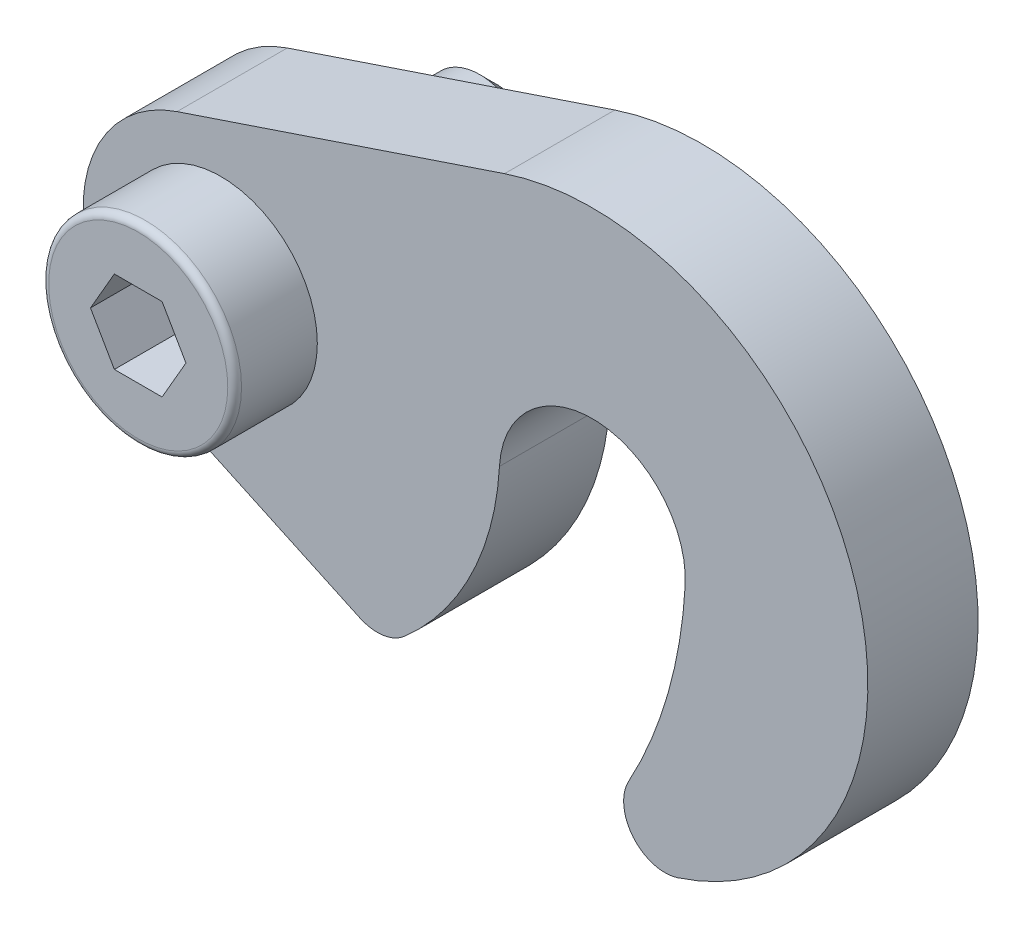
ISO-10303-21;
HEADER;
FILE_DESCRIPTION(('STEP AP214'),'2;1');
FILE_NAME('part.step','',(''),(''),'','','');
FILE_SCHEMA(('AUTOMOTIVE_DESIGN { 1 0 10303 214 1 1 1 1 }'));
ENDSEC;
DATA;
#1=APPLICATION_CONTEXT('core data for automotive mechanical design processes');
#2=APPLICATION_PROTOCOL_DEFINITION('international standard','automotive_design',2000,#1);
#3=PRODUCT_CONTEXT('',#1,'mechanical');
#4=PRODUCT('Part','Part','',(#3));
#5=PRODUCT_RELATED_PRODUCT_CATEGORY('part','',(#4));
#6=PRODUCT_DEFINITION_FORMATION('','',#4);
#7=PRODUCT_DEFINITION_CONTEXT('part definition',#1,'design');
#8=PRODUCT_DEFINITION('design','',#6,#7);
#9=PRODUCT_DEFINITION_SHAPE('','',#8);
#10=(LENGTH_UNIT() NAMED_UNIT(*) SI_UNIT(.MILLI.,.METRE.));
#11=(NAMED_UNIT(*) PLANE_ANGLE_UNIT() SI_UNIT($,.RADIAN.));
#12=(NAMED_UNIT(*) SI_UNIT($,.STERADIAN.) SOLID_ANGLE_UNIT());
#13=UNCERTAINTY_MEASURE_WITH_UNIT(LENGTH_MEASURE(1.E-05),#10,'distance_accuracy_value','');
#14=(GEOMETRIC_REPRESENTATION_CONTEXT(3) GLOBAL_UNCERTAINTY_ASSIGNED_CONTEXT((#13)) GLOBAL_UNIT_ASSIGNED_CONTEXT((#10,
#11,#12)) REPRESENTATION_CONTEXT('',''));
#15=CARTESIAN_POINT('',(0.,0.,0.));
#16=DIRECTION('',(0.,0.,1.));
#17=DIRECTION('',(1.,0.,0.));
#18=AXIS2_PLACEMENT_3D('',#15,#16,#17);
#19=CARTESIAN_POINT('',(0.,0.,1.));
#20=DIRECTION('',(0.,0.,1.));
#21=DIRECTION('',(0.,-1.,0.));
#22=AXIS2_PLACEMENT_3D('',#19,#20,#21);
#23=PLANE('',#22);
#24=CARTESIAN_POINT('',(0.,0.,1.));
#25=DIRECTION('',(0.,0.,-1.));
#26=DIRECTION('',(0.,1.,0.));
#27=AXIS2_PLACEMENT_3D('',#24,#25,#26);
#28=CIRCLE('',#27,5.25);
#29=CARTESIAN_POINT('',(0.,5.25,1.));
#30=VERTEX_POINT('',#29);
#31=EDGE_CURVE('E179',#30,#30,#28,.T.);
#32=ORIENTED_EDGE('',*,*,#31,.F.);
#33=EDGE_LOOP('',(#32));
#34=FACE_BOUND('',#33,.T.);
#35=CARTESIAN_POINT('',(0.,0.,1.));
#36=DIRECTION('',(0.,0.,1.));
#37=DIRECTION('',(0.,-1.,0.));
#38=AXIS2_PLACEMENT_3D('',#35,#36,#37);
#39=CIRCLE('',#38,33.75);
#40=CARTESIAN_POINT('',(29.6010941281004,-16.2122708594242,1.));
#41=VERTEX_POINT('',#40);
#42=CARTESIAN_POINT('',(33.6984313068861,-1.8650006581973,1.));
#43=VERTEX_POINT('',#42);
#44=EDGE_CURVE('E193',#41,#43,#39,.T.);
#45=ORIENTED_EDGE('',*,*,#44,.T.);
#46=CARTESIAN_POINT('',(26.9587450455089,-1.49200052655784,1.));
#47=DIRECTION('',(0.,0.,1.));
#48=DIRECTION('',(0.,-1.,0.));
#49=AXIS2_PLACEMENT_3D('',#46,#47,#48);
#50=CIRCLE('',#49,6.75);
#51=CARTESIAN_POINT('',(20.2190587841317,-1.11900039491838,1.));
#52=VERTEX_POINT('',#51);
#53=EDGE_CURVE('E198',#43,#52,#50,.T.);
#54=ORIENTED_EDGE('',*,*,#53,.T.);
#55=CARTESIAN_POINT('',(0.,0.,1.));
#56=DIRECTION('',(0.,0.,1.));
#57=DIRECTION('',(0.,-1.,0.));
#58=AXIS2_PLACEMENT_3D('',#55,#56,#57);
#59=CIRCLE('',#58,20.25);
#60=CARTESIAN_POINT('',(13.3258827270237,-15.247404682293,1.));
#61=VERTEX_POINT('',#60);
#62=EDGE_CURVE('E201',#61,#52,#59,.T.);
#63=ORIENTED_EDGE('',*,*,#62,.F.);
#64=CARTESIAN_POINT('',(11.3516778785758,-12.9885299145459,1.));
#65=DIRECTION('',(0.,0.,1.));
#66=DIRECTION('',(0.,-1.,0.));
#67=AXIS2_PLACEMENT_3D('',#64,#65,#66);
#68=CIRCLE('',#67,3.);
#69=CARTESIAN_POINT('',(10.0882760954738,-15.7095253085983,1.));
#70=VERTEX_POINT('',#69);
#71=EDGE_CURVE('E204',#70,#61,#68,.T.);
#72=ORIENTED_EDGE('',*,*,#71,.F.);
#73=DIRECTION('',(-0.906998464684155,0.421133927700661,0.));
#74=VECTOR('',#73,1.);
#75=CARTESIAN_POINT('',(10.0882760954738,-15.7095253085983,1.));
#76=LINE('',#75,#74);
#77=CARTESIAN_POINT('',(-4.21133927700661,-9.06998464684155,1.));
#78=VERTEX_POINT('',#77);
#79=EDGE_CURVE('E207',#70,#78,#76,.T.);
#80=ORIENTED_EDGE('',*,*,#79,.T.);
#81=CARTESIAN_POINT('',(0.,0.,1.));
#82=DIRECTION('',(0.,0.,1.));
#83=DIRECTION('',(0.,-1.,0.));
#84=AXIS2_PLACEMENT_3D('',#81,#82,#83);
#85=CIRCLE('',#84,10.);
#86=CARTESIAN_POINT('',(-3.184749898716,9.47931263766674,1.));
#87=VERTEX_POINT('',#86);
#88=EDGE_CURVE('E210',#87,#78,#85,.T.);
#89=ORIENTED_EDGE('',*,*,#88,.F.);
#90=DIRECTION('',(0.947931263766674,0.3184749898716,0.));
#91=VECTOR('',#90,1.);
#92=CARTESIAN_POINT('',(-3.184749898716,9.47931263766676,1.));
#93=LINE('',#92,#91);
#94=CARTESIAN_POINT('',(20.5892452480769,17.4666247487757,1.));
#95=VERTEX_POINT('',#94);
#96=EDGE_CURVE('E213',#87,#95,#93,.T.);
#97=ORIENTED_EDGE('',*,*,#96,.T.);
#98=CARTESIAN_POINT('',(26.9587450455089,-1.49200052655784,1.));
#99=DIRECTION('',(0.,0.,1.));
#100=DIRECTION('',(0.,-1.,0.));
#101=AXIS2_PLACEMENT_3D('',#98,#99,#100);
#102=CIRCLE('',#101,20.);
#103=CARTESIAN_POINT('',(33.1629302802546,-20.5053664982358,1.));
#104=VERTEX_POINT('',#103);
#105=EDGE_CURVE('E216',#104,#95,#102,.T.);
#106=ORIENTED_EDGE('',*,*,#105,.F.);
#107=CARTESIAN_POINT('',(32.2323024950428,-17.6533616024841,1.));
#108=DIRECTION('',(0.,0.,-1.));
#109=DIRECTION('',(0.,1.,0.));
#110=AXIS2_PLACEMENT_3D('',#107,#108,#109);
#111=CIRCLE('',#110,3.);
#112=EDGE_CURVE('E219',#104,#41,#111,.T.);
#113=ORIENTED_EDGE('',*,*,#112,.T.);
#114=EDGE_LOOP('',(#45,#54,#63,#72,#80,#89,#97,#106,#113));
#115=FACE_BOUND('',#114,.T.);
#116=ADVANCED_FACE('F14',(#34,#115),#23,.F.);
#117=CARTESIAN_POINT('',(0.,0.,9.));
#118=DIRECTION('',(0.,0.,-1.));
#119=DIRECTION('',(0.,1.,0.));
#120=AXIS2_PLACEMENT_3D('',#117,#118,#119);
#121=CYLINDRICAL_SURFACE('',#120,33.75);
#122=DIRECTION('',(0.,0.,-1.));
#123=VECTOR('',#122,1.);
#124=CARTESIAN_POINT('',(29.6010941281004,-16.2122708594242,9.));
#125=LINE('',#124,#123);
#126=CARTESIAN_POINT('',(29.6010941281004,-16.2122708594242,9.));
#127=VERTEX_POINT('',#126);
#128=EDGE_CURVE('E37',#127,#41,#125,.T.);
#129=ORIENTED_EDGE('',*,*,#128,.F.);
#130=CARTESIAN_POINT('',(0.,0.,9.));
#131=DIRECTION('',(0.,0.,1.));
#132=DIRECTION('',(0.,-1.,0.));
#133=AXIS2_PLACEMENT_3D('',#130,#131,#132);
#134=CIRCLE('',#133,33.75);
#135=CARTESIAN_POINT('',(33.6984313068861,-1.8650006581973,9.));
#136=VERTEX_POINT('',#135);
#137=EDGE_CURVE('E222',#127,#136,#134,.T.);
#138=ORIENTED_EDGE('',*,*,#137,.T.);
#139=DIRECTION('',(0.,0.,-1.));
#140=VECTOR('',#139,1.);
#141=CARTESIAN_POINT('',(33.6984313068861,-1.8650006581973,9.));
#142=LINE('',#141,#140);
#143=EDGE_CURVE('E248',#136,#43,#142,.T.);
#144=ORIENTED_EDGE('',*,*,#143,.T.);
#145=ORIENTED_EDGE('',*,*,#44,.F.);
#146=EDGE_LOOP('',(#129,#138,#144,#145));
#147=FACE_BOUND('',#146,.T.);
#148=ADVANCED_FACE('F284',(#147),#121,.F.);
#149=CARTESIAN_POINT('',(32.2323024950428,-17.6533616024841,9.));
#150=DIRECTION('',(0.,0.,-1.));
#151=DIRECTION('',(0.,1.,0.));
#152=AXIS2_PLACEMENT_3D('',#149,#150,#151);
#153=CYLINDRICAL_SURFACE('',#152,3.);
#154=DIRECTION('',(0.,0.,-1.));
#155=VECTOR('',#154,1.);
#156=CARTESIAN_POINT('',(33.1629302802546,-20.5053664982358,9.));
#157=LINE('',#156,#155);
#158=CARTESIAN_POINT('',(33.1629302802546,-20.5053664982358,9.));
#159=VERTEX_POINT('',#158);
#160=EDGE_CURVE('E262',#159,#104,#157,.T.);
#161=ORIENTED_EDGE('',*,*,#160,.F.);
#162=CARTESIAN_POINT('',(32.2323024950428,-17.6533616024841,9.));
#163=DIRECTION('',(0.,0.,-1.));
#164=DIRECTION('',(0.,1.,0.));
#165=AXIS2_PLACEMENT_3D('',#162,#163,#164);
#166=CIRCLE('',#165,3.);
#167=EDGE_CURVE('E245',#159,#127,#166,.T.);
#168=ORIENTED_EDGE('',*,*,#167,.T.);
#169=ORIENTED_EDGE('',*,*,#128,.T.);
#170=ORIENTED_EDGE('',*,*,#112,.F.);
#171=EDGE_LOOP('',(#161,#168,#169,#170));
#172=FACE_BOUND('',#171,.T.);
#173=ADVANCED_FACE('F291',(#172),#153,.T.);
#174=CARTESIAN_POINT('',(26.9587450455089,-1.49200052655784,9.));
#175=DIRECTION('',(0.,0.,-1.));
#176=DIRECTION('',(0.,1.,0.));
#177=AXIS2_PLACEMENT_3D('',#174,#175,#176);
#178=CYLINDRICAL_SURFACE('',#177,20.);
#179=DIRECTION('',(0.,0.,-1.));
#180=VECTOR('',#179,1.);
#181=CARTESIAN_POINT('',(20.5892452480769,17.4666247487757,9.));
#182=LINE('',#181,#180);
#183=CARTESIAN_POINT('',(20.5892452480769,17.4666247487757,9.));
#184=VERTEX_POINT('',#183);
#185=EDGE_CURVE('E260',#184,#95,#182,.T.);
#186=ORIENTED_EDGE('',*,*,#185,.F.);
#187=CARTESIAN_POINT('',(26.9587450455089,-1.49200052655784,9.));
#188=DIRECTION('',(0.,0.,1.));
#189=DIRECTION('',(0.,-1.,0.));
#190=AXIS2_PLACEMENT_3D('',#187,#188,#189);
#191=CIRCLE('',#190,20.);
#192=EDGE_CURVE('E242',#159,#184,#191,.T.);
#193=ORIENTED_EDGE('',*,*,#192,.F.);
#194=ORIENTED_EDGE('',*,*,#160,.T.);
#195=ORIENTED_EDGE('',*,*,#105,.T.);
#196=EDGE_LOOP('',(#186,#193,#194,#195));
#197=FACE_BOUND('',#196,.T.);
#198=ADVANCED_FACE('F327',(#197),#178,.T.);
#199=CARTESIAN_POINT('',(-3.184749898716,9.47931263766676,9.));
#200=DIRECTION('',(-0.3184749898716,0.947931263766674,0.));
#201=DIRECTION('',(-0.947931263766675,-0.3184749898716,0.));
#202=AXIS2_PLACEMENT_3D('',#199,#200,#201);
#203=PLANE('',#202);
#204=DIRECTION('',(0.,0.,-1.));
#205=VECTOR('',#204,1.);
#206=CARTESIAN_POINT('',(-3.184749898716,9.47931263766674,9.));
#207=LINE('',#206,#205);
#208=CARTESIAN_POINT('',(-3.184749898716,9.47931263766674,9.));
#209=VERTEX_POINT('',#208);
#210=EDGE_CURVE('E258',#209,#87,#207,.T.);
#211=ORIENTED_EDGE('',*,*,#210,.F.);
#212=DIRECTION('',(0.947931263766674,0.3184749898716,0.));
#213=VECTOR('',#212,1.);
#214=CARTESIAN_POINT('',(-3.184749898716,9.47931263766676,9.));
#215=LINE('',#214,#213);
#216=EDGE_CURVE('E239',#209,#184,#215,.T.);
#217=ORIENTED_EDGE('',*,*,#216,.T.);
#218=ORIENTED_EDGE('',*,*,#185,.T.);
#219=ORIENTED_EDGE('',*,*,#96,.F.);
#220=EDGE_LOOP('',(#211,#217,#218,#219));
#221=FACE_BOUND('',#220,.T.);
#222=ADVANCED_FACE('F323',(#221),#203,.T.);
#223=CARTESIAN_POINT('',(0.,0.,9.));
#224=DIRECTION('',(0.,0.,-1.));
#225=DIRECTION('',(0.,1.,0.));
#226=AXIS2_PLACEMENT_3D('',#223,#224,#225);
#227=CYLINDRICAL_SURFACE('',#226,10.);
#228=DIRECTION('',(0.,0.,-1.));
#229=VECTOR('',#228,1.);
#230=CARTESIAN_POINT('',(-4.21133927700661,-9.06998464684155,9.));
#231=LINE('',#230,#229);
#232=CARTESIAN_POINT('',(-4.21133927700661,-9.06998464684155,9.));
#233=VERTEX_POINT('',#232);
#234=EDGE_CURVE('E256',#233,#78,#231,.T.);
#235=ORIENTED_EDGE('',*,*,#234,.F.);
#236=CARTESIAN_POINT('',(0.,0.,9.));
#237=DIRECTION('',(0.,0.,1.));
#238=DIRECTION('',(0.,-1.,0.));
#239=AXIS2_PLACEMENT_3D('',#236,#237,#238);
#240=CIRCLE('',#239,10.);
#241=EDGE_CURVE('E236',#209,#233,#240,.T.);
#242=ORIENTED_EDGE('',*,*,#241,.F.);
#243=ORIENTED_EDGE('',*,*,#210,.T.);
#244=ORIENTED_EDGE('',*,*,#88,.T.);
#245=EDGE_LOOP('',(#235,#242,#243,#244));
#246=FACE_BOUND('',#245,.T.);
#247=ADVANCED_FACE('F319',(#246),#227,.T.);
#248=CARTESIAN_POINT('',(10.0882760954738,-15.7095253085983,9.));
#249=DIRECTION('',(-0.421133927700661,-0.906998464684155,0.));
#250=DIRECTION('',(0.906998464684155,-0.421133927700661,0.));
#251=AXIS2_PLACEMENT_3D('',#248,#249,#250);
#252=PLANE('',#251);
#253=DIRECTION('',(0.,0.,-1.));
#254=VECTOR('',#253,1.);
#255=CARTESIAN_POINT('',(10.0882760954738,-15.7095253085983,9.));
#256=LINE('',#255,#254);
#257=CARTESIAN_POINT('',(10.0882760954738,-15.7095253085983,9.));
#258=VERTEX_POINT('',#257);
#259=EDGE_CURVE('E254',#258,#70,#256,.T.);
#260=ORIENTED_EDGE('',*,*,#259,.F.);
#261=DIRECTION('',(-0.906998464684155,0.421133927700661,0.));
#262=VECTOR('',#261,1.);
#263=CARTESIAN_POINT('',(10.0882760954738,-15.7095253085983,9.));
#264=LINE('',#263,#262);
#265=EDGE_CURVE('E233',#258,#233,#264,.T.);
#266=ORIENTED_EDGE('',*,*,#265,.T.);
#267=ORIENTED_EDGE('',*,*,#234,.T.);
#268=ORIENTED_EDGE('',*,*,#79,.F.);
#269=EDGE_LOOP('',(#260,#266,#267,#268));
#270=FACE_BOUND('',#269,.T.);
#271=ADVANCED_FACE('F315',(#270),#252,.T.);
#272=CARTESIAN_POINT('',(11.3516778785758,-12.9885299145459,9.));
#273=DIRECTION('',(0.,0.,-1.));
#274=DIRECTION('',(0.,1.,0.));
#275=AXIS2_PLACEMENT_3D('',#272,#273,#274);
#276=CYLINDRICAL_SURFACE('',#275,3.);
#277=DIRECTION('',(0.,0.,-1.));
#278=VECTOR('',#277,1.);
#279=CARTESIAN_POINT('',(13.3258827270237,-15.247404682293,9.));
#280=LINE('',#279,#278);
#281=CARTESIAN_POINT('',(13.3258827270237,-15.247404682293,9.));
#282=VERTEX_POINT('',#281);
#283=EDGE_CURVE('E252',#282,#61,#280,.T.);
#284=ORIENTED_EDGE('',*,*,#283,.F.);
#285=CARTESIAN_POINT('',(11.3516778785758,-12.9885299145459,9.));
#286=DIRECTION('',(0.,0.,1.));
#287=DIRECTION('',(0.,-1.,0.));
#288=AXIS2_PLACEMENT_3D('',#285,#286,#287);
#289=CIRCLE('',#288,3.);
#290=EDGE_CURVE('E230',#258,#282,#289,.T.);
#291=ORIENTED_EDGE('',*,*,#290,.F.);
#292=ORIENTED_EDGE('',*,*,#259,.T.);
#293=ORIENTED_EDGE('',*,*,#71,.T.);
#294=EDGE_LOOP('',(#284,#291,#292,#293));
#295=FACE_BOUND('',#294,.T.);
#296=ADVANCED_FACE('F311',(#295),#276,.T.);
#297=CARTESIAN_POINT('',(0.,0.,9.));
#298=DIRECTION('',(0.,0.,-1.));
#299=DIRECTION('',(0.,1.,0.));
#300=AXIS2_PLACEMENT_3D('',#297,#298,#299);
#301=CYLINDRICAL_SURFACE('',#300,20.25);
#302=DIRECTION('',(0.,0.,-1.));
#303=VECTOR('',#302,1.);
#304=CARTESIAN_POINT('',(20.2190587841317,-1.11900039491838,9.));
#305=LINE('',#304,#303);
#306=CARTESIAN_POINT('',(20.2190587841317,-1.11900039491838,9.));
#307=VERTEX_POINT('',#306);
#308=EDGE_CURVE('E250',#307,#52,#305,.T.);
#309=ORIENTED_EDGE('',*,*,#308,.F.);
#310=CARTESIAN_POINT('',(0.,0.,9.));
#311=DIRECTION('',(0.,0.,1.));
#312=DIRECTION('',(0.,-1.,0.));
#313=AXIS2_PLACEMENT_3D('',#310,#311,#312);
#314=CIRCLE('',#313,20.25);
#315=EDGE_CURVE('E227',#282,#307,#314,.T.);
#316=ORIENTED_EDGE('',*,*,#315,.F.);
#317=ORIENTED_EDGE('',*,*,#283,.T.);
#318=ORIENTED_EDGE('',*,*,#62,.T.);
#319=EDGE_LOOP('',(#309,#316,#317,#318));
#320=FACE_BOUND('',#319,.T.);
#321=ADVANCED_FACE('F303',(#320),#301,.T.);
#322=CARTESIAN_POINT('',(26.9587450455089,-1.49200052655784,9.));
#323=DIRECTION('',(0.,0.,-1.));
#324=DIRECTION('',(0.,1.,0.));
#325=AXIS2_PLACEMENT_3D('',#322,#323,#324);
#326=CYLINDRICAL_SURFACE('',#325,6.75);
#327=CARTESIAN_POINT('',(26.9587450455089,-1.49200052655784,9.));
#328=DIRECTION('',(0.,0.,1.));
#329=DIRECTION('',(0.,-1.,0.));
#330=AXIS2_PLACEMENT_3D('',#327,#328,#329);
#331=CIRCLE('',#330,6.75);
#332=EDGE_CURVE('E224',#136,#307,#331,.T.);
#333=ORIENTED_EDGE('',*,*,#332,.T.);
#334=ORIENTED_EDGE('',*,*,#308,.T.);
#335=ORIENTED_EDGE('',*,*,#53,.F.);
#336=ORIENTED_EDGE('',*,*,#143,.F.);
#337=EDGE_LOOP('',(#333,#334,#335,#336));
#338=FACE_BOUND('',#337,.T.);
#339=ADVANCED_FACE('F301',(#338),#326,.F.);
#340=CARTESIAN_POINT('',(0.,0.,9.));
#341=DIRECTION('',(0.,0.,1.));
#342=DIRECTION('',(0.,-1.,0.));
#343=AXIS2_PLACEMENT_3D('',#340,#341,#342);
#344=PLANE('',#343);
#345=CARTESIAN_POINT('',(0.,0.,9.));
#346=DIRECTION('',(0.,0.,1.));
#347=DIRECTION('',(0.,-1.,0.));
#348=AXIS2_PLACEMENT_3D('',#345,#346,#347);
#349=CIRCLE('',#348,7.);
#350=CARTESIAN_POINT('',(0.,-7.,9.));
#351=VERTEX_POINT('',#350);
#352=EDGE_CURVE('E190',#351,#351,#349,.T.);
#353=ORIENTED_EDGE('',*,*,#352,.F.);
#354=EDGE_LOOP('',(#353));
#355=FACE_BOUND('',#354,.T.);
#356=ORIENTED_EDGE('',*,*,#137,.F.);
#357=ORIENTED_EDGE('',*,*,#167,.F.);
#358=ORIENTED_EDGE('',*,*,#192,.T.);
#359=ORIENTED_EDGE('',*,*,#216,.F.);
#360=ORIENTED_EDGE('',*,*,#241,.T.);
#361=ORIENTED_EDGE('',*,*,#265,.F.);
#362=ORIENTED_EDGE('',*,*,#290,.T.);
#363=ORIENTED_EDGE('',*,*,#315,.T.);
#364=ORIENTED_EDGE('',*,*,#332,.F.);
#365=EDGE_LOOP('',(#356,#357,#358,#359,#360,#361,#362,#363,#364));
#366=FACE_BOUND('',#365,.T.);
#367=ADVANCED_FACE('F299',(#355,#366),#344,.T.);
#368=CARTESIAN_POINT('',(0.,0.,15.));
#369=DIRECTION('',(0.,0.,-1.));
#370=DIRECTION('',(0.,1.,0.));
#371=AXIS2_PLACEMENT_3D('',#368,#369,#370);
#372=CYLINDRICAL_SURFACE('',#371,7.);
#373=CARTESIAN_POINT('',(0.,0.,14.5));
#374=DIRECTION('',(0.,0.,1.));
#375=DIRECTION('',(1.,0.,0.));
#376=AXIS2_PLACEMENT_3D('',#373,#374,#375);
#377=CIRCLE('',#376,7.);
#378=CARTESIAN_POINT('',(7.,0.,14.5));
#379=VERTEX_POINT('',#378);
#380=EDGE_CURVE('E267',#379,#379,#377,.F.);
#381=ORIENTED_EDGE('',*,*,#380,.T.);
#382=EDGE_LOOP('',(#381));
#383=FACE_BOUND('',#382,.T.);
#384=ORIENTED_EDGE('',*,*,#352,.T.);
#385=EDGE_LOOP('',(#384));
#386=FACE_BOUND('',#385,.T.);
#387=ADVANCED_FACE('F297',(#383,#386),#372,.T.);
#388=CARTESIAN_POINT('',(0.,0.,15.));
#389=DIRECTION('',(0.,0.,1.));
#390=DIRECTION('',(0.,-1.,0.));
#391=AXIS2_PLACEMENT_3D('',#388,#389,#390);
#392=PLANE('',#391);
#393=DIRECTION('',(0.5,0.866025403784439,0.));
#394=VECTOR('',#393,1.);
#395=CARTESIAN_POINT('',(1.73205080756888,-3.,15.));
#396=LINE('',#395,#394);
#397=CARTESIAN_POINT('',(1.73205080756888,-3.,15.));
#398=VERTEX_POINT('',#397);
#399=CARTESIAN_POINT('',(3.46410161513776,0.,15.));
#400=VERTEX_POINT('',#399);
#401=EDGE_CURVE('E29',#398,#400,#396,.T.);
#402=ORIENTED_EDGE('',*,*,#401,.F.);
#403=DIRECTION('',(1.,0.,0.));
#404=VECTOR('',#403,1.);
#405=CARTESIAN_POINT('',(-1.73205080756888,-3.,15.));
#406=LINE('',#405,#404);
#407=CARTESIAN_POINT('',(-1.73205080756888,-3.,15.));
#408=VERTEX_POINT('',#407);
#409=EDGE_CURVE('E143',#408,#398,#406,.T.);
#410=ORIENTED_EDGE('',*,*,#409,.F.);
#411=DIRECTION('',(0.5,-0.866025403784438,0.));
#412=VECTOR('',#411,1.);
#413=CARTESIAN_POINT('',(-3.46410161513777,0.,15.));
#414=LINE('',#413,#412);
#415=CARTESIAN_POINT('',(-3.46410161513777,0.,15.));
#416=VERTEX_POINT('',#415);
#417=EDGE_CURVE('E146',#416,#408,#414,.T.);
#418=ORIENTED_EDGE('',*,*,#417,.F.);
#419=DIRECTION('',(-0.5,-0.866025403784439,0.));
#420=VECTOR('',#419,1.);
#421=CARTESIAN_POINT('',(-1.73205080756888,3.,15.));
#422=LINE('',#421,#420);
#423=CARTESIAN_POINT('',(-1.73205080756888,3.,15.));
#424=VERTEX_POINT('',#423);
#425=EDGE_CURVE('E162',#424,#416,#422,.T.);
#426=ORIENTED_EDGE('',*,*,#425,.F.);
#427=DIRECTION('',(-1.,0.,0.));
#428=VECTOR('',#427,1.);
#429=CARTESIAN_POINT('',(1.73205080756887,3.,15.));
#430=LINE('',#429,#428);
#431=CARTESIAN_POINT('',(1.73205080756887,3.,15.));
#432=VERTEX_POINT('',#431);
#433=EDGE_CURVE('E159',#432,#424,#430,.T.);
#434=ORIENTED_EDGE('',*,*,#433,.F.);
#435=DIRECTION('',(-0.5,0.866025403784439,0.));
#436=VECTOR('',#435,1.);
#437=CARTESIAN_POINT('',(3.46410161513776,0.,15.));
#438=LINE('',#437,#436);
#439=EDGE_CURVE('E157',#400,#432,#438,.T.);
#440=ORIENTED_EDGE('',*,*,#439,.F.);
#441=EDGE_LOOP('',(#402,#410,#418,#426,#434,#440));
#442=FACE_BOUND('',#441,.T.);
#443=CARTESIAN_POINT('',(0.,0.,15.));
#444=DIRECTION('',(0.,0.,1.));
#445=DIRECTION('',(1.,0.,0.));
#446=AXIS2_PLACEMENT_3D('',#443,#444,#445);
#447=CIRCLE('',#446,6.5);
#448=CARTESIAN_POINT('',(6.5,0.,15.));
#449=VERTEX_POINT('',#448);
#450=EDGE_CURVE('E189',#449,#449,#447,.T.);
#451=ORIENTED_EDGE('',*,*,#450,.T.);
#452=EDGE_LOOP('',(#451));
#453=FACE_BOUND('',#452,.T.);
#454=ADVANCED_FACE('F308',(#442,#453),#392,.T.);
#455=CARTESIAN_POINT('',(0.,0.,9.));
#456=DIRECTION('',(0.,0.,-1.));
#457=DIRECTION('',(0.,1.,0.));
#458=AXIS2_PLACEMENT_3D('',#455,#456,#457);
#459=CYLINDRICAL_SURFACE('',#458,5.25);
#460=CARTESIAN_POINT('',(0.,0.,9.));
#461=DIRECTION('',(0.,0.,-1.));
#462=DIRECTION('',(0.,1.,0.));
#463=AXIS2_PLACEMENT_3D('',#460,#461,#462);
#464=CIRCLE('',#463,5.25);
#465=CARTESIAN_POINT('',(0.,5.25,9.));
#466=VERTEX_POINT('',#465);
#467=EDGE_CURVE('E182',#466,#466,#464,.T.);
#468=ORIENTED_EDGE('',*,*,#467,.F.);
#469=EDGE_LOOP('',(#468));
#470=FACE_BOUND('',#469,.T.);
#471=ORIENTED_EDGE('',*,*,#31,.T.);
#472=EDGE_LOOP('',(#471));
#473=FACE_BOUND('',#472,.T.);
#474=ADVANCED_FACE('F353',(#470,#473),#459,.F.);
#475=CARTESIAN_POINT('',(0.,0.,9.));
#476=DIRECTION('',(0.,0.,-1.));
#477=DIRECTION('',(0.,1.,0.));
#478=AXIS2_PLACEMENT_3D('',#475,#476,#477);
#479=PLANE('',#478);
#480=CARTESIAN_POINT('',(0.,0.,9.));
#481=DIRECTION('',(0.,0.,-1.));
#482=DIRECTION('',(0.,1.,0.));
#483=AXIS2_PLACEMENT_3D('',#480,#481,#482);
#484=CIRCLE('',#483,5.);
#485=CARTESIAN_POINT('',(0.,5.,9.));
#486=VERTEX_POINT('',#485);
#487=EDGE_CURVE('E169',#486,#486,#484,.T.);
#488=ORIENTED_EDGE('',*,*,#487,.F.);
#489=EDGE_LOOP('',(#488));
#490=FACE_BOUND('',#489,.T.);
#491=ORIENTED_EDGE('',*,*,#467,.T.);
#492=EDGE_LOOP('',(#491));
#493=FACE_BOUND('',#492,.T.);
#494=ADVANCED_FACE('F360',(#490,#493),#479,.T.);
#495=CARTESIAN_POINT('',(0.,0.,-11.));
#496=DIRECTION('',(0.,0.,-1.));
#497=DIRECTION('',(0.,1.,0.));
#498=AXIS2_PLACEMENT_3D('',#495,#496,#497);
#499=PLANE('',#498);
#500=CARTESIAN_POINT('',(0.,0.,-11.));
#501=DIRECTION('',(0.,0.,-1.));
#502=DIRECTION('',(-1.,0.,0.));
#503=AXIS2_PLACEMENT_3D('',#500,#501,#502);
#504=CIRCLE('',#503,2.8);
#505=CARTESIAN_POINT('',(-2.8,0.,-11.));
#506=VERTEX_POINT('',#505);
#507=EDGE_CURVE('E22',#506,#506,#504,.T.);
#508=ORIENTED_EDGE('',*,*,#507,.T.);
#509=EDGE_LOOP('',(#508));
#510=FACE_BOUND('',#509,.T.);
#511=ADVANCED_FACE('F272',(#510),#499,.T.);
#512=CARTESIAN_POINT('',(0.,0.,-11.));
#513=DIRECTION('',(0.,0.,1.));
#514=DIRECTION('',(0.,-1.,0.));
#515=AXIS2_PLACEMENT_3D('',#512,#513,#514);
#516=CYLINDRICAL_SURFACE('',#515,4.);
#517=CARTESIAN_POINT('',(0.,0.,-9.8));
#518=DIRECTION('',(0.,0.,-1.));
#519=DIRECTION('',(-1.,0.,0.));
#520=AXIS2_PLACEMENT_3D('',#517,#518,#519);
#521=CIRCLE('',#520,4.);
#522=CARTESIAN_POINT('',(-4.,0.,-9.8));
#523=VERTEX_POINT('',#522);
#524=EDGE_CURVE('E9',#523,#523,#521,.F.);
#525=ORIENTED_EDGE('',*,*,#524,.T.);
#526=EDGE_LOOP('',(#525));
#527=FACE_BOUND('',#526,.T.);
#528=CARTESIAN_POINT('',(0.,0.,0.));
#529=DIRECTION('',(0.,0.,-1.));
#530=DIRECTION('',(0.,1.,0.));
#531=AXIS2_PLACEMENT_3D('',#528,#529,#530);
#532=CIRCLE('',#531,4.);
#533=CARTESIAN_POINT('',(0.,4.,0.));
#534=VERTEX_POINT('',#533);
#535=EDGE_CURVE('E186',#534,#534,#532,.T.);
#536=ORIENTED_EDGE('',*,*,#535,.T.);
#537=EDGE_LOOP('',(#536));
#538=FACE_BOUND('',#537,.T.);
#539=ADVANCED_FACE('F367',(#527,#538),#516,.T.);
#540=CARTESIAN_POINT('',(0.,0.,0.));
#541=DIRECTION('',(0.,0.,-1.));
#542=DIRECTION('',(0.,1.,0.));
#543=AXIS2_PLACEMENT_3D('',#540,#541,#542);
#544=PLANE('',#543);
#545=ORIENTED_EDGE('',*,*,#535,.F.);
#546=EDGE_LOOP('',(#545));
#547=FACE_BOUND('',#546,.T.);
#548=CARTESIAN_POINT('',(0.,0.,0.));
#549=DIRECTION('',(0.,0.,-1.));
#550=DIRECTION('',(0.,1.,0.));
#551=AXIS2_PLACEMENT_3D('',#548,#549,#550);
#552=CIRCLE('',#551,5.);
#553=CARTESIAN_POINT('',(0.,5.,0.));
#554=VERTEX_POINT('',#553);
#555=EDGE_CURVE('E185',#554,#554,#552,.T.);
#556=ORIENTED_EDGE('',*,*,#555,.T.);
#557=EDGE_LOOP('',(#556));
#558=FACE_BOUND('',#557,.T.);
#559=ADVANCED_FACE('F345',(#547,#558),#544,.T.);
#560=CARTESIAN_POINT('',(0.,0.,0.));
#561=DIRECTION('',(0.,0.,1.));
#562=DIRECTION('',(0.,-1.,0.));
#563=AXIS2_PLACEMENT_3D('',#560,#561,#562);
#564=CYLINDRICAL_SURFACE('',#563,5.);
#565=ORIENTED_EDGE('',*,*,#555,.F.);
#566=EDGE_LOOP('',(#565));
#567=FACE_BOUND('',#566,.T.);
#568=ORIENTED_EDGE('',*,*,#487,.T.);
#569=EDGE_LOOP('',(#568));
#570=FACE_BOUND('',#569,.T.);
#571=ADVANCED_FACE('F336',(#567,#570),#564,.T.);
#572=CARTESIAN_POINT('',(0.,0.,14.5));
#573=DIRECTION('',(0.,0.,1.));
#574=DIRECTION('',(1.,0.,0.));
#575=AXIS2_PLACEMENT_3D('',#572,#573,#574);
#576=TOROIDAL_SURFACE('',#575,6.5,0.5);
#577=ORIENTED_EDGE('',*,*,#380,.F.);
#578=EDGE_LOOP('',(#577));
#579=FACE_BOUND('',#578,.T.);
#580=ORIENTED_EDGE('',*,*,#450,.F.);
#581=EDGE_LOOP('',(#580));
#582=FACE_BOUND('',#581,.T.);
#583=ADVANCED_FACE('F334',(#579,#582),#576,.T.);
#584=CARTESIAN_POINT('',(1.73205080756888,-3.,10.5));
#585=DIRECTION('',(0.866025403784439,-0.5,0.));
#586=DIRECTION('',(0.5,0.866025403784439,0.));
#587=AXIS2_PLACEMENT_3D('',#584,#585,#586);
#588=PLANE('',#587);
#589=ORIENTED_EDGE('',*,*,#401,.T.);
#590=DIRECTION('',(0.,0.,1.));
#591=VECTOR('',#590,1.);
#592=CARTESIAN_POINT('',(3.46410161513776,0.,10.5));
#593=LINE('',#592,#591);
#594=CARTESIAN_POINT('',(3.46410161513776,0.,10.5));
#595=VERTEX_POINT('',#594);
#596=EDGE_CURVE('E120',#595,#400,#593,.T.);
#597=ORIENTED_EDGE('',*,*,#596,.F.);
#598=DIRECTION('',(0.5,0.866025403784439,0.));
#599=VECTOR('',#598,1.);
#600=CARTESIAN_POINT('',(1.73205080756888,-3.,10.5));
#601=LINE('',#600,#599);
#602=CARTESIAN_POINT('',(1.73205080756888,-3.,10.5));
#603=VERTEX_POINT('',#602);
#604=EDGE_CURVE('E124',#603,#595,#601,.T.);
#605=ORIENTED_EDGE('',*,*,#604,.F.);
#606=DIRECTION('',(0.,0.,1.));
#607=VECTOR('',#606,1.);
#608=CARTESIAN_POINT('',(1.73205080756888,-3.,10.5));
#609=LINE('',#608,#607);
#610=EDGE_CURVE('E167',#603,#398,#609,.T.);
#611=ORIENTED_EDGE('',*,*,#610,.T.);
#612=EDGE_LOOP('',(#589,#597,#605,#611));
#613=FACE_BOUND('',#612,.T.);
#614=ADVANCED_FACE('F122',(#613),#588,.F.);
#615=CARTESIAN_POINT('',(-1.73205080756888,-3.,10.5));
#616=DIRECTION('',(0.,-1.,0.));
#617=DIRECTION('',(0.,0.,-1.));
#618=AXIS2_PLACEMENT_3D('',#615,#616,#617);
#619=PLANE('',#618);
#620=ORIENTED_EDGE('',*,*,#409,.T.);
#621=ORIENTED_EDGE('',*,*,#610,.F.);
#622=DIRECTION('',(1.,0.,0.));
#623=VECTOR('',#622,1.);
#624=CARTESIAN_POINT('',(-1.73205080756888,-3.,10.5));
#625=LINE('',#624,#623);
#626=CARTESIAN_POINT('',(-1.73205080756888,-3.,10.5));
#627=VERTEX_POINT('',#626);
#628=EDGE_CURVE('E130',#627,#603,#625,.T.);
#629=ORIENTED_EDGE('',*,*,#628,.F.);
#630=DIRECTION('',(0.,0.,1.));
#631=VECTOR('',#630,1.);
#632=CARTESIAN_POINT('',(-1.73205080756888,-3.,10.5));
#633=LINE('',#632,#631);
#634=EDGE_CURVE('E170',#627,#408,#633,.T.);
#635=ORIENTED_EDGE('',*,*,#634,.T.);
#636=EDGE_LOOP('',(#620,#621,#629,#635));
#637=FACE_BOUND('',#636,.T.);
#638=ADVANCED_FACE('F343',(#637),#619,.F.);
#639=CARTESIAN_POINT('',(-3.46410161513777,0.,10.5));
#640=DIRECTION('',(-0.866025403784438,-0.5,0.));
#641=DIRECTION('',(0.5,-0.866025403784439,0.));
#642=AXIS2_PLACEMENT_3D('',#639,#640,#641);
#643=PLANE('',#642);
#644=ORIENTED_EDGE('',*,*,#417,.T.);
#645=ORIENTED_EDGE('',*,*,#634,.F.);
#646=DIRECTION('',(0.5,-0.866025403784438,0.));
#647=VECTOR('',#646,1.);
#648=CARTESIAN_POINT('',(-3.46410161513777,0.,10.5));
#649=LINE('',#648,#647);
#650=CARTESIAN_POINT('',(-3.46410161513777,0.,10.5));
#651=VERTEX_POINT('',#650);
#652=EDGE_CURVE('E153',#651,#627,#649,.T.);
#653=ORIENTED_EDGE('',*,*,#652,.F.);
#654=DIRECTION('',(0.,0.,1.));
#655=VECTOR('',#654,1.);
#656=CARTESIAN_POINT('',(-3.46410161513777,0.,10.5));
#657=LINE('',#656,#655);
#658=EDGE_CURVE('E172',#651,#416,#657,.T.);
#659=ORIENTED_EDGE('',*,*,#658,.T.);
#660=EDGE_LOOP('',(#644,#645,#653,#659));
#661=FACE_BOUND('',#660,.T.);
#662=ADVANCED_FACE('F386',(#661),#643,.F.);
#663=CARTESIAN_POINT('',(-1.73205080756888,3.,10.5));
#664=DIRECTION('',(-0.866025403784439,0.5,0.));
#665=DIRECTION('',(-0.5,-0.866025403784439,0.));
#666=AXIS2_PLACEMENT_3D('',#663,#664,#665);
#667=PLANE('',#666);
#668=ORIENTED_EDGE('',*,*,#425,.T.);
#669=ORIENTED_EDGE('',*,*,#658,.F.);
#670=DIRECTION('',(-0.5,-0.866025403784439,0.));
#671=VECTOR('',#670,1.);
#672=CARTESIAN_POINT('',(-1.73205080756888,3.,10.5));
#673=LINE('',#672,#671);
#674=CARTESIAN_POINT('',(-1.73205080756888,3.,10.5));
#675=VERTEX_POINT('',#674);
#676=EDGE_CURVE('E150',#675,#651,#673,.T.);
#677=ORIENTED_EDGE('',*,*,#676,.F.);
#678=DIRECTION('',(0.,0.,1.));
#679=VECTOR('',#678,1.);
#680=CARTESIAN_POINT('',(-1.73205080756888,3.,10.5));
#681=LINE('',#680,#679);
#682=EDGE_CURVE('E174',#675,#424,#681,.T.);
#683=ORIENTED_EDGE('',*,*,#682,.T.);
#684=EDGE_LOOP('',(#668,#669,#677,#683));
#685=FACE_BOUND('',#684,.T.);
#686=ADVANCED_FACE('F382',(#685),#667,.F.);
#687=CARTESIAN_POINT('',(1.73205080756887,3.,10.5));
#688=DIRECTION('',(0.,1.,0.));
#689=DIRECTION('',(-1.,0.,0.));
#690=AXIS2_PLACEMENT_3D('',#687,#688,#689);
#691=PLANE('',#690);
#692=ORIENTED_EDGE('',*,*,#433,.T.);
#693=ORIENTED_EDGE('',*,*,#682,.F.);
#694=DIRECTION('',(-1.,0.,0.));
#695=VECTOR('',#694,1.);
#696=CARTESIAN_POINT('',(1.73205080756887,3.,10.5));
#697=LINE('',#696,#695);
#698=CARTESIAN_POINT('',(1.73205080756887,3.,10.5));
#699=VERTEX_POINT('',#698);
#700=EDGE_CURVE('E138',#699,#675,#697,.T.);
#701=ORIENTED_EDGE('',*,*,#700,.F.);
#702=DIRECTION('',(0.,0.,1.));
#703=VECTOR('',#702,1.);
#704=CARTESIAN_POINT('',(1.73205080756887,3.,10.5));
#705=LINE('',#704,#703);
#706=EDGE_CURVE('E129',#699,#432,#705,.T.);
#707=ORIENTED_EDGE('',*,*,#706,.T.);
#708=EDGE_LOOP('',(#692,#693,#701,#707));
#709=FACE_BOUND('',#708,.T.);
#710=ADVANCED_FACE('F379',(#709),#691,.F.);
#711=CARTESIAN_POINT('',(3.46410161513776,0.,10.5));
#712=DIRECTION('',(0.866025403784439,0.5,0.));
#713=DIRECTION('',(-0.5,0.866025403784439,0.));
#714=AXIS2_PLACEMENT_3D('',#711,#712,#713);
#715=PLANE('',#714);
#716=ORIENTED_EDGE('',*,*,#439,.T.);
#717=ORIENTED_EDGE('',*,*,#706,.F.);
#718=DIRECTION('',(-0.5,0.866025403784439,0.));
#719=VECTOR('',#718,1.);
#720=CARTESIAN_POINT('',(3.46410161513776,0.,10.5));
#721=LINE('',#720,#719);
#722=EDGE_CURVE('E133',#595,#699,#721,.T.);
#723=ORIENTED_EDGE('',*,*,#722,.F.);
#724=ORIENTED_EDGE('',*,*,#596,.T.);
#725=EDGE_LOOP('',(#716,#717,#723,#724));
#726=FACE_BOUND('',#725,.T.);
#727=ADVANCED_FACE('F134',(#726),#715,.F.);
#728=CARTESIAN_POINT('',(3.46410161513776,0.,10.5));
#729=DIRECTION('',(0.,0.,1.));
#730=DIRECTION('',(1.,0.,0.));
#731=AXIS2_PLACEMENT_3D('',#728,#729,#730);
#732=PLANE('',#731);
#733=ORIENTED_EDGE('',*,*,#604,.T.);
#734=ORIENTED_EDGE('',*,*,#722,.T.);
#735=ORIENTED_EDGE('',*,*,#700,.T.);
#736=ORIENTED_EDGE('',*,*,#676,.T.);
#737=ORIENTED_EDGE('',*,*,#652,.T.);
#738=ORIENTED_EDGE('',*,*,#628,.T.);
#739=EDGE_LOOP('',(#733,#734,#735,#736,#737,#738));
#740=FACE_BOUND('',#739,.T.);
#741=ADVANCED_FACE('F140',(#740),#732,.T.);
#742=CARTESIAN_POINT('',(0.,0.,-11.));
#743=DIRECTION('',(0.,0.,1.));
#744=DIRECTION('',(1.,0.,0.));
#745=AXIS2_PLACEMENT_3D('',#742,#743,#744);
#746=CONICAL_SURFACE('',#745,2.8,0.785398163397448);
#747=ORIENTED_EDGE('',*,*,#524,.F.);
#748=EDGE_LOOP('',(#747));
#749=FACE_BOUND('',#748,.T.);
#750=ORIENTED_EDGE('',*,*,#507,.F.);
#751=EDGE_LOOP('',(#750));
#752=FACE_BOUND('',#751,.T.);
#753=ADVANCED_FACE('F16',(#749,#752),#746,.T.);
#754=CLOSED_SHELL('',(#116,#148,#173,#198,#222,#247,#271,#296,#321,#339,#367,#387,#454,#474,
#494,#511,#539,#559,#571,#583,#614,#638,#662,#686,#710,#727,#741,#753));
#755=MANIFOLD_SOLID_BREP('B1',#754);
#756=ADVANCED_BREP_SHAPE_REPRESENTATION('',(#18,#755),#14);
#757=SHAPE_DEFINITION_REPRESENTATION(#9,#756);
ENDSEC;
END-ISO-10303-21;
